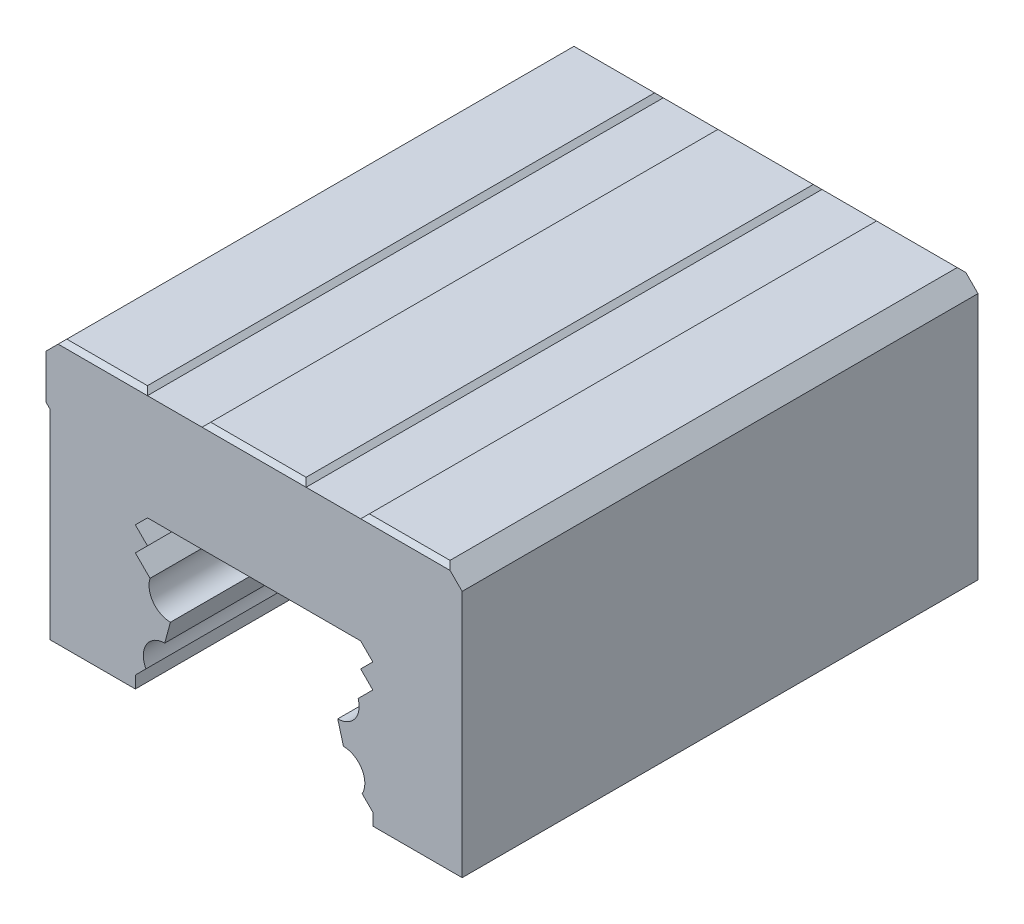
ISO-10303-21;
HEADER;
FILE_DESCRIPTION(('STEP AP214'),'2;1');
FILE_NAME('part.step','',(''),(''),'','','');
FILE_SCHEMA(('AUTOMOTIVE_DESIGN { 1 0 10303 214 1 1 1 1 }'));
ENDSEC;
DATA;
#1=APPLICATION_CONTEXT('core data for automotive mechanical design processes');
#2=APPLICATION_PROTOCOL_DEFINITION('international standard','automotive_design',2000,#1);
#3=PRODUCT_CONTEXT('',#1,'mechanical');
#4=PRODUCT('Part','Part','',(#3));
#5=PRODUCT_RELATED_PRODUCT_CATEGORY('part','',(#4));
#6=PRODUCT_DEFINITION_FORMATION('','',#4);
#7=PRODUCT_DEFINITION_CONTEXT('part definition',#1,'design');
#8=PRODUCT_DEFINITION('design','',#6,#7);
#9=PRODUCT_DEFINITION_SHAPE('','',#8);
#10=(LENGTH_UNIT() NAMED_UNIT(*) SI_UNIT(.MILLI.,.METRE.));
#11=(NAMED_UNIT(*) PLANE_ANGLE_UNIT() SI_UNIT($,.RADIAN.));
#12=(NAMED_UNIT(*) SI_UNIT($,.STERADIAN.) SOLID_ANGLE_UNIT());
#13=UNCERTAINTY_MEASURE_WITH_UNIT(LENGTH_MEASURE(1.E-05),#10,'distance_accuracy_value','');
#14=(GEOMETRIC_REPRESENTATION_CONTEXT(3) GLOBAL_UNCERTAINTY_ASSIGNED_CONTEXT((#13)) GLOBAL_UNIT_ASSIGNED_CONTEXT((#10,
#11,#12)) REPRESENTATION_CONTEXT('',''));
#15=CARTESIAN_POINT('',(0.,0.,0.));
#16=DIRECTION('',(0.,0.,1.));
#17=DIRECTION('',(1.,0.,0.));
#18=AXIS2_PLACEMENT_3D('',#15,#16,#17);
#19=CARTESIAN_POINT('',(9.493,20.8372459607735,29.75));
#20=DIRECTION('',(0.,0.,-1.));
#21=DIRECTION('',(-1.,0.,0.));
#22=AXIS2_PLACEMENT_3D('',#19,#20,#21);
#23=PLANE('',#22);
#24=DIRECTION('',(-0.707106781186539,0.707106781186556,0.));
#25=VECTOR('',#24,1.);
#26=CARTESIAN_POINT('',(-13.6951640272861,19.1012214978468,29.75));
#27=LINE('',#26,#25);
#28=CARTESIAN_POINT('',(-12.0003317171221,17.4063891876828,29.75));
#29=VERTEX_POINT('',#28);
#30=CARTESIAN_POINT('',(-13.6951640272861,19.1012214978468,29.75));
#31=VERTEX_POINT('',#30);
#32=EDGE_CURVE('E312',#29,#31,#27,.T.);
#33=ORIENTED_EDGE('',*,*,#32,.T.);
#34=DIRECTION('',(0.707106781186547,0.707106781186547,0.));
#35=VECTOR('',#34,1.);
#36=CARTESIAN_POINT('',(-12.2955711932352,20.5008143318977,29.75));
#37=LINE('',#36,#35);
#38=CARTESIAN_POINT('',(-12.2955711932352,20.5008143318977,29.75));
#39=VERTEX_POINT('',#38);
#40=EDGE_CURVE('E611',#31,#39,#37,.T.);
#41=ORIENTED_EDGE('',*,*,#40,.T.);
#42=DIRECTION('',(-0.707106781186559,0.707106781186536,0.));
#43=VECTOR('',#42,1.);
#44=CARTESIAN_POINT('',(-13.6951640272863,21.9004071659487,29.75));
#45=LINE('',#44,#43);
#46=CARTESIAN_POINT('',(-13.6951640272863,21.9004071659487,29.75));
#47=VERTEX_POINT('',#46);
#48=EDGE_CURVE('E609',#39,#47,#45,.T.);
#49=ORIENTED_EDGE('',*,*,#48,.T.);
#50=DIRECTION('',(0.707106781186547,0.707106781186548,0.));
#51=VECTOR('',#50,1.);
#52=CARTESIAN_POINT('',(-12.2955711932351,23.3,29.75));
#53=LINE('',#52,#51);
#54=CARTESIAN_POINT('',(-12.2955711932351,23.3,29.75));
#55=VERTEX_POINT('',#54);
#56=EDGE_CURVE('E337',#47,#55,#53,.T.);
#57=ORIENTED_EDGE('',*,*,#56,.T.);
#58=DIRECTION('',(1.,0.,0.));
#59=VECTOR('',#58,1.);
#60=CARTESIAN_POINT('',(-8.15000000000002,23.3,29.75));
#61=LINE('',#60,#59);
#62=CARTESIAN_POINT('',(12.2955711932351,23.3,29.75));
#63=VERTEX_POINT('',#62);
#64=EDGE_CURVE('E315',#55,#63,#61,.T.);
#65=ORIENTED_EDGE('',*,*,#64,.T.);
#66=DIRECTION('',(-0.707106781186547,0.707106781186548,0.));
#67=VECTOR('',#66,1.);
#68=CARTESIAN_POINT('',(12.2955711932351,23.3,29.75));
#69=LINE('',#68,#67);
#70=CARTESIAN_POINT('',(13.6951640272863,21.9004071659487,29.75));
#71=VERTEX_POINT('',#70);
#72=EDGE_CURVE('E345',#71,#63,#69,.T.);
#73=ORIENTED_EDGE('',*,*,#72,.F.);
#74=DIRECTION('',(0.707106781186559,0.707106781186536,0.));
#75=VECTOR('',#74,1.);
#76=CARTESIAN_POINT('',(13.6951640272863,21.9004071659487,29.75));
#77=LINE('',#76,#75);
#78=CARTESIAN_POINT('',(12.2955711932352,20.5008143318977,29.75));
#79=VERTEX_POINT('',#78);
#80=EDGE_CURVE('E359',#79,#71,#77,.T.);
#81=ORIENTED_EDGE('',*,*,#80,.F.);
#82=DIRECTION('',(-0.707106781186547,0.707106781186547,0.));
#83=VECTOR('',#82,1.);
#84=CARTESIAN_POINT('',(12.2955711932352,20.5008143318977,29.75));
#85=LINE('',#84,#83);
#86=CARTESIAN_POINT('',(13.6951640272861,19.1012214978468,29.75));
#87=VERTEX_POINT('',#86);
#88=EDGE_CURVE('E355',#87,#79,#85,.T.);
#89=ORIENTED_EDGE('',*,*,#88,.F.);
#90=DIRECTION('',(0.707106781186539,0.707106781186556,0.));
#91=VECTOR('',#90,1.);
#92=CARTESIAN_POINT('',(13.6951640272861,19.1012214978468,29.75));
#93=LINE('',#92,#91);
#94=CARTESIAN_POINT('',(12.0003317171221,17.4063891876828,29.75));
#95=VERTEX_POINT('',#94);
#96=EDGE_CURVE('E352',#95,#87,#93,.T.);
#97=ORIENTED_EDGE('',*,*,#96,.F.);
#98=CARTESIAN_POINT('',(9.65,16.66,29.75));
#99=DIRECTION('',(0.,0.,-1.));
#100=DIRECTION('',(-1.,0.,0.));
#101=AXIS2_PLACEMENT_3D('',#98,#99,#100);
#102=CIRCLE('',#101,2.466);
#103=CARTESIAN_POINT('',(9.65,14.194,29.75));
#104=VERTEX_POINT('',#103);
#105=EDGE_CURVE('E395',#104,#95,#102,.F.);
#106=ORIENTED_EDGE('',*,*,#105,.F.);
#107=DIRECTION('',(-0.263319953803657,0.964708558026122,0.));
#108=VECTOR('',#107,1.);
#109=CARTESIAN_POINT('',(7.95155010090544,20.4165028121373,29.75));
#110=LINE('',#109,#108);
#111=CARTESIAN_POINT('',(10.31,11.776,29.75));
#112=VERTEX_POINT('',#111);
#113=EDGE_CURVE('E398',#112,#104,#110,.T.);
#114=ORIENTED_EDGE('',*,*,#113,.F.);
#115=CARTESIAN_POINT('',(10.31,9.31,29.75));
#116=DIRECTION('',(0.,0.,-1.));
#117=DIRECTION('',(-1.,0.,0.));
#118=AXIS2_PLACEMENT_3D('',#115,#116,#117);
#119=CIRCLE('',#118,2.466);
#120=CARTESIAN_POINT('',(12.4716066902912,8.12315017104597,29.75));
#121=VERTEX_POINT('',#120);
#122=EDGE_CURVE('E400',#121,#112,#119,.F.);
#123=ORIENTED_EDGE('',*,*,#122,.F.);
#124=DIRECTION('',(-0.707106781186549,0.707106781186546,0.));
#125=VECTOR('',#124,1.);
#126=CARTESIAN_POINT('',(13.6951640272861,6.89959283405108,29.75));
#127=LINE('',#126,#125);
#128=CARTESIAN_POINT('',(13.6951640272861,6.89959283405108,29.75));
#129=VERTEX_POINT('',#128);
#130=EDGE_CURVE('E65',#129,#121,#127,.T.);
#131=ORIENTED_EDGE('',*,*,#130,.F.);
#132=DIRECTION('',(0.,1.,0.));
#133=VECTOR('',#132,1.);
#134=CARTESIAN_POINT('',(13.6951640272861,6.89959283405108,29.75));
#135=LINE('',#134,#133);
#136=CARTESIAN_POINT('',(13.6951640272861,5.5,29.75));
#137=VERTEX_POINT('',#136);
#138=EDGE_CURVE('E356',#137,#129,#135,.T.);
#139=ORIENTED_EDGE('',*,*,#138,.F.);
#140=DIRECTION('',(1.,0.,0.));
#141=VECTOR('',#140,1.);
#142=CARTESIAN_POINT('',(10.3433796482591,5.5,29.75));
#143=LINE('',#142,#141);
#144=CARTESIAN_POINT('',(24.,5.5,29.75));
#145=VERTEX_POINT('',#144);
#146=EDGE_CURVE('E300',#137,#145,#143,.T.);
#147=ORIENTED_EDGE('',*,*,#146,.T.);
#148=DIRECTION('',(0.,1.,0.));
#149=VECTOR('',#148,1.);
#150=CARTESIAN_POINT('',(24.,5.5,29.75));
#151=LINE('',#150,#149);
#152=CARTESIAN_POINT('',(24.,34.1,29.75));
#153=VERTEX_POINT('',#152);
#154=EDGE_CURVE('E417',#145,#153,#151,.T.);
#155=ORIENTED_EDGE('',*,*,#154,.T.);
#156=DIRECTION('',(-0.707106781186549,0.707106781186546,0.));
#157=VECTOR('',#156,1.);
#158=CARTESIAN_POINT('',(24.,34.1,29.75));
#159=LINE('',#158,#157);
#160=CARTESIAN_POINT('',(22.6,35.5,29.75));
#161=VERTEX_POINT('',#160);
#162=EDGE_CURVE('E419',#153,#161,#159,.T.);
#163=ORIENTED_EDGE('',*,*,#162,.T.);
#164=DIRECTION('',(-1.,0.,0.));
#165=VECTOR('',#164,1.);
#166=CARTESIAN_POINT('',(9.49299999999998,35.5,29.75));
#167=LINE('',#166,#165);
#168=CARTESIAN_POINT('',(12.3,35.5,29.75));
#169=VERTEX_POINT('',#168);
#170=EDGE_CURVE('E516',#161,#169,#167,.T.);
#171=ORIENTED_EDGE('',*,*,#170,.T.);
#172=DIRECTION('',(-1.,0.,0.));
#173=VECTOR('',#172,1.);
#174=CARTESIAN_POINT('',(5.99999999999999,35.5,29.75));
#175=LINE('',#174,#173);
#176=CARTESIAN_POINT('',(5.99999999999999,35.5,29.75));
#177=VERTEX_POINT('',#176);
#178=EDGE_CURVE('E422',#169,#177,#175,.T.);
#179=ORIENTED_EDGE('',*,*,#178,.T.);
#180=DIRECTION('',(-1.,0.,0.));
#181=VECTOR('',#180,1.);
#182=CARTESIAN_POINT('',(9.493,35.5,29.75));
#183=LINE('',#182,#181);
#184=CARTESIAN_POINT('',(-6.,35.5,29.75));
#185=VERTEX_POINT('',#184);
#186=EDGE_CURVE('E510',#177,#185,#183,.T.);
#187=ORIENTED_EDGE('',*,*,#186,.T.);
#188=DIRECTION('',(-1.,0.,0.));
#189=VECTOR('',#188,1.);
#190=CARTESIAN_POINT('',(-12.3,35.5,29.75));
#191=LINE('',#190,#189);
#192=CARTESIAN_POINT('',(-12.3,35.5,29.75));
#193=VERTEX_POINT('',#192);
#194=EDGE_CURVE('E425',#185,#193,#191,.T.);
#195=ORIENTED_EDGE('',*,*,#194,.T.);
#196=DIRECTION('',(-1.,0.,0.));
#197=VECTOR('',#196,1.);
#198=CARTESIAN_POINT('',(9.49299999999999,35.5,29.75));
#199=LINE('',#198,#197);
#200=CARTESIAN_POINT('',(-22.6,35.5,29.75));
#201=VERTEX_POINT('',#200);
#202=EDGE_CURVE('E513',#193,#201,#199,.T.);
#203=ORIENTED_EDGE('',*,*,#202,.T.);
#204=DIRECTION('',(-0.707106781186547,-0.707106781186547,0.));
#205=VECTOR('',#204,1.);
#206=CARTESIAN_POINT('',(-24.,34.1,29.75));
#207=LINE('',#206,#205);
#208=CARTESIAN_POINT('',(-24.,34.1,29.75));
#209=VERTEX_POINT('',#208);
#210=EDGE_CURVE('E428',#201,#209,#207,.T.);
#211=ORIENTED_EDGE('',*,*,#210,.T.);
#212=DIRECTION('',(0.,-1.,0.));
#213=VECTOR('',#212,1.);
#214=CARTESIAN_POINT('',(-24.,29.,29.75));
#215=LINE('',#214,#213);
#216=CARTESIAN_POINT('',(-24.,29.,29.75));
#217=VERTEX_POINT('',#216);
#218=EDGE_CURVE('E430',#209,#217,#215,.T.);
#219=ORIENTED_EDGE('',*,*,#218,.T.);
#220=DIRECTION('',(0.707106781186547,-0.707106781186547,0.));
#221=VECTOR('',#220,1.);
#222=CARTESIAN_POINT('',(-23.55,28.55,29.75));
#223=LINE('',#222,#221);
#224=CARTESIAN_POINT('',(-23.55,28.55,29.75));
#225=VERTEX_POINT('',#224);
#226=EDGE_CURVE('E432',#217,#225,#223,.T.);
#227=ORIENTED_EDGE('',*,*,#226,.T.);
#228=DIRECTION('',(0.,-1.,0.));
#229=VECTOR('',#228,1.);
#230=CARTESIAN_POINT('',(-23.55,5.5,29.75));
#231=LINE('',#230,#229);
#232=CARTESIAN_POINT('',(-23.55,5.5,29.75));
#233=VERTEX_POINT('',#232);
#234=EDGE_CURVE('E434',#225,#233,#231,.T.);
#235=ORIENTED_EDGE('',*,*,#234,.T.);
#236=DIRECTION('',(1.,0.,0.));
#237=VECTOR('',#236,1.);
#238=CARTESIAN_POINT('',(-10.3433796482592,5.5,29.75));
#239=LINE('',#238,#237);
#240=CARTESIAN_POINT('',(-13.6951640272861,5.5,29.75));
#241=VERTEX_POINT('',#240);
#242=EDGE_CURVE('E436',#233,#241,#239,.T.);
#243=ORIENTED_EDGE('',*,*,#242,.T.);
#244=DIRECTION('',(0.,1.,0.));
#245=VECTOR('',#244,1.);
#246=CARTESIAN_POINT('',(-13.6951640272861,6.89959283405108,29.75));
#247=LINE('',#246,#245);
#248=CARTESIAN_POINT('',(-13.6951640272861,6.89959283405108,29.75));
#249=VERTEX_POINT('',#248);
#250=EDGE_CURVE('E326',#241,#249,#247,.T.);
#251=ORIENTED_EDGE('',*,*,#250,.T.);
#252=DIRECTION('',(0.707106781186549,0.707106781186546,0.));
#253=VECTOR('',#252,1.);
#254=CARTESIAN_POINT('',(-13.6951640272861,6.89959283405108,29.75));
#255=LINE('',#254,#253);
#256=CARTESIAN_POINT('',(-12.4716066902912,8.12315017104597,29.75));
#257=VERTEX_POINT('',#256);
#258=EDGE_CURVE('E329',#249,#257,#255,.T.);
#259=ORIENTED_EDGE('',*,*,#258,.T.);
#260=CARTESIAN_POINT('',(-10.31,9.31,29.75));
#261=DIRECTION('',(0.,0.,-1.));
#262=DIRECTION('',(-1.,0.,0.));
#263=AXIS2_PLACEMENT_3D('',#260,#261,#262);
#264=CIRCLE('',#263,2.466);
#265=CARTESIAN_POINT('',(-10.31,11.776,29.75));
#266=VERTEX_POINT('',#265);
#267=EDGE_CURVE('E413',#257,#266,#264,.T.);
#268=ORIENTED_EDGE('',*,*,#267,.T.);
#269=DIRECTION('',(0.263319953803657,0.964708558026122,0.));
#270=VECTOR('',#269,1.);
#271=CARTESIAN_POINT('',(-6.6351102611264,25.2394596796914,29.75));
#272=LINE('',#271,#270);
#273=CARTESIAN_POINT('',(-9.65,14.194,29.75));
#274=VERTEX_POINT('',#273);
#275=EDGE_CURVE('E411',#266,#274,#272,.T.);
#276=ORIENTED_EDGE('',*,*,#275,.T.);
#277=CARTESIAN_POINT('',(-9.65,16.66,29.75));
#278=DIRECTION('',(0.,0.,-1.));
#279=DIRECTION('',(-1.,0.,0.));
#280=AXIS2_PLACEMENT_3D('',#277,#278,#279);
#281=CIRCLE('',#280,2.466);
#282=EDGE_CURVE('E408',#274,#29,#281,.T.);
#283=ORIENTED_EDGE('',*,*,#282,.T.);
#284=EDGE_LOOP('',(#33,#41,#49,#57,#65,#73,#81,#89,#97,#106,#114,#123,#131,#139,#147,#155,#163,
#171,#179,#187,#195,#203,#211,#219,#227,#235,#243,#251,#259,#268,#276,#283));
#285=FACE_BOUND('',#284,.T.);
#286=ADVANCED_FACE('F42',(#285),#23,.F.);
#287=CARTESIAN_POINT('',(9.493,20.8372459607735,-29.75));
#288=DIRECTION('',(0.,0.,-1.));
#289=DIRECTION('',(-1.,0.,0.));
#290=AXIS2_PLACEMENT_3D('',#287,#288,#289);
#291=PLANE('',#290);
#292=DIRECTION('',(0.707106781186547,0.707106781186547,0.));
#293=VECTOR('',#292,1.);
#294=CARTESIAN_POINT('',(-12.2955711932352,20.5008143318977,-29.75));
#295=LINE('',#294,#293);
#296=CARTESIAN_POINT('',(-13.6951640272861,19.1012214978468,-29.75));
#297=VERTEX_POINT('',#296);
#298=CARTESIAN_POINT('',(-12.2955711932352,20.5008143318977,-29.75));
#299=VERTEX_POINT('',#298);
#300=EDGE_CURVE('E320',#297,#299,#295,.T.);
#301=ORIENTED_EDGE('',*,*,#300,.F.);
#302=DIRECTION('',(-0.707106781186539,0.707106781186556,0.));
#303=VECTOR('',#302,1.);
#304=CARTESIAN_POINT('',(-13.6951640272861,19.1012214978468,-29.75));
#305=LINE('',#304,#303);
#306=CARTESIAN_POINT('',(-12.0003317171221,17.4063891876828,-29.75));
#307=VERTEX_POINT('',#306);
#308=EDGE_CURVE('E316',#307,#297,#305,.T.);
#309=ORIENTED_EDGE('',*,*,#308,.F.);
#310=CARTESIAN_POINT('',(-9.65,16.66,-29.75));
#311=DIRECTION('',(0.,0.,-1.));
#312=DIRECTION('',(-1.,0.,0.));
#313=AXIS2_PLACEMENT_3D('',#310,#311,#312);
#314=CIRCLE('',#313,2.466);
#315=CARTESIAN_POINT('',(-9.65,14.194,-29.75));
#316=VERTEX_POINT('',#315);
#317=EDGE_CURVE('E564',#316,#307,#314,.T.);
#318=ORIENTED_EDGE('',*,*,#317,.F.);
#319=DIRECTION('',(0.263319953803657,0.964708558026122,0.));
#320=VECTOR('',#319,1.);
#321=CARTESIAN_POINT('',(-6.6351102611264,25.2394596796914,-29.75));
#322=LINE('',#321,#320);
#323=CARTESIAN_POINT('',(-10.31,11.776,-29.75));
#324=VERTEX_POINT('',#323);
#325=EDGE_CURVE('E567',#324,#316,#322,.T.);
#326=ORIENTED_EDGE('',*,*,#325,.F.);
#327=CARTESIAN_POINT('',(-10.31,9.31,-29.75));
#328=DIRECTION('',(0.,0.,-1.));
#329=DIRECTION('',(-1.,0.,0.));
#330=AXIS2_PLACEMENT_3D('',#327,#328,#329);
#331=CIRCLE('',#330,2.466);
#332=CARTESIAN_POINT('',(-12.4716066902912,8.12315017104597,-29.75));
#333=VERTEX_POINT('',#332);
#334=EDGE_CURVE('E570',#333,#324,#331,.T.);
#335=ORIENTED_EDGE('',*,*,#334,.F.);
#336=DIRECTION('',(0.707106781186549,0.707106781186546,0.));
#337=VECTOR('',#336,1.);
#338=CARTESIAN_POINT('',(-13.6951640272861,6.89959283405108,-29.75));
#339=LINE('',#338,#337);
#340=CARTESIAN_POINT('',(-13.6951640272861,6.89959283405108,-29.75));
#341=VERTEX_POINT('',#340);
#342=EDGE_CURVE('E57',#341,#333,#339,.T.);
#343=ORIENTED_EDGE('',*,*,#342,.F.);
#344=DIRECTION('',(0.,1.,0.));
#345=VECTOR('',#344,1.);
#346=CARTESIAN_POINT('',(-13.6951640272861,6.89959283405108,-29.75));
#347=LINE('',#346,#345);
#348=CARTESIAN_POINT('',(-13.6951640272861,5.5,-29.75));
#349=VERTEX_POINT('',#348);
#350=EDGE_CURVE('E325',#349,#341,#347,.T.);
#351=ORIENTED_EDGE('',*,*,#350,.F.);
#352=DIRECTION('',(1.,0.,0.));
#353=VECTOR('',#352,1.);
#354=CARTESIAN_POINT('',(-10.3433796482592,5.5,-29.75));
#355=LINE('',#354,#353);
#356=CARTESIAN_POINT('',(-23.55,5.5,-29.75));
#357=VERTEX_POINT('',#356);
#358=EDGE_CURVE('E301',#357,#349,#355,.T.);
#359=ORIENTED_EDGE('',*,*,#358,.F.);
#360=DIRECTION('',(0.,-1.,0.));
#361=VECTOR('',#360,1.);
#362=CARTESIAN_POINT('',(-23.55,5.5,-29.75));
#363=LINE('',#362,#361);
#364=CARTESIAN_POINT('',(-23.55,28.55,-29.75));
#365=VERTEX_POINT('',#364);
#366=EDGE_CURVE('E459',#365,#357,#363,.T.);
#367=ORIENTED_EDGE('',*,*,#366,.F.);
#368=DIRECTION('',(0.707106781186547,-0.707106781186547,0.));
#369=VECTOR('',#368,1.);
#370=CARTESIAN_POINT('',(-23.55,28.55,-29.75));
#371=LINE('',#370,#369);
#372=CARTESIAN_POINT('',(-24.,29.,-29.75));
#373=VERTEX_POINT('',#372);
#374=EDGE_CURVE('E457',#373,#365,#371,.T.);
#375=ORIENTED_EDGE('',*,*,#374,.F.);
#376=DIRECTION('',(0.,-1.,0.));
#377=VECTOR('',#376,1.);
#378=CARTESIAN_POINT('',(-24.,29.,-29.75));
#379=LINE('',#378,#377);
#380=CARTESIAN_POINT('',(-24.,34.1,-29.75));
#381=VERTEX_POINT('',#380);
#382=EDGE_CURVE('E455',#381,#373,#379,.T.);
#383=ORIENTED_EDGE('',*,*,#382,.F.);
#384=DIRECTION('',(-0.707106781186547,-0.707106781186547,0.));
#385=VECTOR('',#384,1.);
#386=CARTESIAN_POINT('',(-24.,34.1,-29.75));
#387=LINE('',#386,#385);
#388=CARTESIAN_POINT('',(-22.6,35.5,-29.75));
#389=VERTEX_POINT('',#388);
#390=EDGE_CURVE('E453',#389,#381,#387,.T.);
#391=ORIENTED_EDGE('',*,*,#390,.F.);
#392=DIRECTION('',(1.,0.,0.));
#393=VECTOR('',#392,1.);
#394=CARTESIAN_POINT('',(-12.8,35.5,-29.75));
#395=LINE('',#394,#393);
#396=CARTESIAN_POINT('',(-12.3,35.5,-29.75));
#397=VERTEX_POINT('',#396);
#398=EDGE_CURVE('E562',#389,#397,#395,.T.);
#399=ORIENTED_EDGE('',*,*,#398,.T.);
#400=DIRECTION('',(-1.,0.,0.));
#401=VECTOR('',#400,1.);
#402=CARTESIAN_POINT('',(-12.3,35.5,-29.75));
#403=LINE('',#402,#401);
#404=CARTESIAN_POINT('',(-6.,35.5,-29.75));
#405=VERTEX_POINT('',#404);
#406=EDGE_CURVE('E450',#405,#397,#403,.T.);
#407=ORIENTED_EDGE('',*,*,#406,.F.);
#408=DIRECTION('',(1.,0.,0.));
#409=VECTOR('',#408,1.);
#410=CARTESIAN_POINT('',(5.5,35.5,-29.75));
#411=LINE('',#410,#409);
#412=CARTESIAN_POINT('',(5.99999999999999,35.5,-29.75));
#413=VERTEX_POINT('',#412);
#414=EDGE_CURVE('E558',#405,#413,#411,.T.);
#415=ORIENTED_EDGE('',*,*,#414,.T.);
#416=DIRECTION('',(-1.,0.,0.));
#417=VECTOR('',#416,1.);
#418=CARTESIAN_POINT('',(5.99999999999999,35.5,-29.75));
#419=LINE('',#418,#417);
#420=CARTESIAN_POINT('',(12.3,35.5,-29.75));
#421=VERTEX_POINT('',#420);
#422=EDGE_CURVE('E447',#421,#413,#419,.T.);
#423=ORIENTED_EDGE('',*,*,#422,.F.);
#424=DIRECTION('',(1.,0.,0.));
#425=VECTOR('',#424,1.);
#426=CARTESIAN_POINT('',(22.1,35.5,-29.75));
#427=LINE('',#426,#425);
#428=CARTESIAN_POINT('',(22.6,35.5,-29.75));
#429=VERTEX_POINT('',#428);
#430=EDGE_CURVE('E560',#421,#429,#427,.T.);
#431=ORIENTED_EDGE('',*,*,#430,.T.);
#432=DIRECTION('',(-0.707106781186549,0.707106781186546,0.));
#433=VECTOR('',#432,1.);
#434=CARTESIAN_POINT('',(24.,34.1,-29.75));
#435=LINE('',#434,#433);
#436=CARTESIAN_POINT('',(24.,34.1,-29.75));
#437=VERTEX_POINT('',#436);
#438=EDGE_CURVE('E444',#437,#429,#435,.T.);
#439=ORIENTED_EDGE('',*,*,#438,.F.);
#440=DIRECTION('',(0.,1.,0.));
#441=VECTOR('',#440,1.);
#442=CARTESIAN_POINT('',(24.,5.5,-29.75));
#443=LINE('',#442,#441);
#444=CARTESIAN_POINT('',(24.,5.5,-29.75));
#445=VERTEX_POINT('',#444);
#446=EDGE_CURVE('E442',#445,#437,#443,.T.);
#447=ORIENTED_EDGE('',*,*,#446,.F.);
#448=DIRECTION('',(1.,0.,0.));
#449=VECTOR('',#448,1.);
#450=CARTESIAN_POINT('',(10.3433796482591,5.5,-29.75));
#451=LINE('',#450,#449);
#452=CARTESIAN_POINT('',(13.6951640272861,5.5,-29.75));
#453=VERTEX_POINT('',#452);
#454=EDGE_CURVE('E415',#453,#445,#451,.T.);
#455=ORIENTED_EDGE('',*,*,#454,.F.);
#456=DIRECTION('',(0.,1.,0.));
#457=VECTOR('',#456,1.);
#458=CARTESIAN_POINT('',(13.6951640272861,6.89959283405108,-29.75));
#459=LINE('',#458,#457);
#460=CARTESIAN_POINT('',(13.6951640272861,6.89959283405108,-29.75));
#461=VERTEX_POINT('',#460);
#462=EDGE_CURVE('E383',#453,#461,#459,.T.);
#463=ORIENTED_EDGE('',*,*,#462,.T.);
#464=DIRECTION('',(-0.707106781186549,0.707106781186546,0.));
#465=VECTOR('',#464,1.);
#466=CARTESIAN_POINT('',(13.6951640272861,6.89959283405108,-29.75));
#467=LINE('',#466,#465);
#468=CARTESIAN_POINT('',(12.4716066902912,8.12315017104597,-29.75));
#469=VERTEX_POINT('',#468);
#470=EDGE_CURVE('E376',#461,#469,#467,.T.);
#471=ORIENTED_EDGE('',*,*,#470,.T.);
#472=CARTESIAN_POINT('',(10.31,9.31,-29.75));
#473=DIRECTION('',(0.,0.,-1.));
#474=DIRECTION('',(-1.,0.,0.));
#475=AXIS2_PLACEMENT_3D('',#472,#473,#474);
#476=CIRCLE('',#475,2.466);
#477=CARTESIAN_POINT('',(10.31,11.776,-29.75));
#478=VERTEX_POINT('',#477);
#479=EDGE_CURVE('E11',#469,#478,#476,.F.);
#480=ORIENTED_EDGE('',*,*,#479,.T.);
#481=DIRECTION('',(-0.263319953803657,0.964708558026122,0.));
#482=VECTOR('',#481,1.);
#483=CARTESIAN_POINT('',(7.95155010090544,20.4165028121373,-29.75));
#484=LINE('',#483,#482);
#485=CARTESIAN_POINT('',(9.65,14.194,-29.75));
#486=VERTEX_POINT('',#485);
#487=EDGE_CURVE('E50',#478,#486,#484,.T.);
#488=ORIENTED_EDGE('',*,*,#487,.T.);
#489=CARTESIAN_POINT('',(9.65,16.66,-29.75));
#490=DIRECTION('',(0.,0.,-1.));
#491=DIRECTION('',(-1.,0.,0.));
#492=AXIS2_PLACEMENT_3D('',#489,#490,#491);
#493=CIRCLE('',#492,2.466);
#494=CARTESIAN_POINT('',(12.0003317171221,17.4063891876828,-29.75));
#495=VERTEX_POINT('',#494);
#496=EDGE_CURVE('E572',#486,#495,#493,.F.);
#497=ORIENTED_EDGE('',*,*,#496,.T.);
#498=DIRECTION('',(0.707106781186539,0.707106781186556,0.));
#499=VECTOR('',#498,1.);
#500=CARTESIAN_POINT('',(13.6951640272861,19.1012214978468,-29.75));
#501=LINE('',#500,#499);
#502=CARTESIAN_POINT('',(13.6951640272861,19.1012214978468,-29.75));
#503=VERTEX_POINT('',#502);
#504=EDGE_CURVE('E341',#495,#503,#501,.T.);
#505=ORIENTED_EDGE('',*,*,#504,.T.);
#506=DIRECTION('',(-0.707106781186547,0.707106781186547,0.));
#507=VECTOR('',#506,1.);
#508=CARTESIAN_POINT('',(12.2955711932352,20.5008143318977,-29.75));
#509=LINE('',#508,#507);
#510=CARTESIAN_POINT('',(12.2955711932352,20.5008143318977,-29.75));
#511=VERTEX_POINT('',#510);
#512=EDGE_CURVE('E344',#503,#511,#509,.T.);
#513=ORIENTED_EDGE('',*,*,#512,.T.);
#514=DIRECTION('',(0.707106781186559,0.707106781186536,0.));
#515=VECTOR('',#514,1.);
#516=CARTESIAN_POINT('',(13.6951640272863,21.9004071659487,-29.75));
#517=LINE('',#516,#515);
#518=CARTESIAN_POINT('',(13.6951640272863,21.9004071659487,-29.75));
#519=VERTEX_POINT('',#518);
#520=EDGE_CURVE('E348',#511,#519,#517,.T.);
#521=ORIENTED_EDGE('',*,*,#520,.T.);
#522=DIRECTION('',(-0.707106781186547,0.707106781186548,0.));
#523=VECTOR('',#522,1.);
#524=CARTESIAN_POINT('',(12.2955711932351,23.3,-29.75));
#525=LINE('',#524,#523);
#526=CARTESIAN_POINT('',(12.2955711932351,23.3,-29.75));
#527=VERTEX_POINT('',#526);
#528=EDGE_CURVE('E295',#519,#527,#525,.T.);
#529=ORIENTED_EDGE('',*,*,#528,.T.);
#530=DIRECTION('',(1.,0.,0.));
#531=VECTOR('',#530,1.);
#532=CARTESIAN_POINT('',(-8.15000000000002,23.3,-29.75));
#533=LINE('',#532,#531);
#534=CARTESIAN_POINT('',(-12.2955711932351,23.3,-29.75));
#535=VERTEX_POINT('',#534);
#536=EDGE_CURVE('E287',#535,#527,#533,.T.);
#537=ORIENTED_EDGE('',*,*,#536,.F.);
#538=DIRECTION('',(0.707106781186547,0.707106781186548,0.));
#539=VECTOR('',#538,1.);
#540=CARTESIAN_POINT('',(-12.2955711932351,23.3,-29.75));
#541=LINE('',#540,#539);
#542=CARTESIAN_POINT('',(-13.6951640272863,21.9004071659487,-29.75));
#543=VERTEX_POINT('',#542);
#544=EDGE_CURVE('E292',#543,#535,#541,.T.);
#545=ORIENTED_EDGE('',*,*,#544,.F.);
#546=DIRECTION('',(-0.707106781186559,0.707106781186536,0.));
#547=VECTOR('',#546,1.);
#548=CARTESIAN_POINT('',(-13.6951640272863,21.9004071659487,-29.75));
#549=LINE('',#548,#547);
#550=EDGE_CURVE('E311',#299,#543,#549,.T.);
#551=ORIENTED_EDGE('',*,*,#550,.F.);
#552=EDGE_LOOP('',(#301,#309,#318,#326,#335,#343,#351,#359,#367,#375,#383,#391,#399,#407,#415,
#423,#431,#439,#447,#455,#463,#471,#480,#488,#497,#505,#513,#521,#529,#537,#545,#551));
#553=FACE_BOUND('',#552,.T.);
#554=ADVANCED_FACE('F290',(#553),#291,.T.);
#555=CARTESIAN_POINT('',(-10.3433796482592,5.5,29.75));
#556=DIRECTION('',(0.,1.,0.));
#557=DIRECTION('',(-1.,0.,0.));
#558=AXIS2_PLACEMENT_3D('',#555,#556,#557);
#559=PLANE('',#558);
#560=DIRECTION('',(0.,0.,1.));
#561=VECTOR('',#560,1.);
#562=CARTESIAN_POINT('',(-13.6951640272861,5.5,-29.75));
#563=LINE('',#562,#561);
#564=EDGE_CURVE('E334',#349,#241,#563,.T.);
#565=ORIENTED_EDGE('',*,*,#564,.T.);
#566=ORIENTED_EDGE('',*,*,#242,.F.);
#567=DIRECTION('',(0.,0.,-1.));
#568=VECTOR('',#567,1.);
#569=CARTESIAN_POINT('',(-23.55,5.5,29.75));
#570=LINE('',#569,#568);
#571=EDGE_CURVE('E440',#233,#357,#570,.T.);
#572=ORIENTED_EDGE('',*,*,#571,.T.);
#573=ORIENTED_EDGE('',*,*,#358,.T.);
#574=EDGE_LOOP('',(#565,#566,#572,#573));
#575=FACE_BOUND('',#574,.T.);
#576=ADVANCED_FACE('F648',(#575),#559,.F.);
#577=CARTESIAN_POINT('',(-10.31,9.31,207.009188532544));
#578=DIRECTION('',(0.,0.,-1.));
#579=DIRECTION('',(-1.,0.,0.));
#580=AXIS2_PLACEMENT_3D('',#577,#578,#579);
#581=CYLINDRICAL_SURFACE('',#580,2.466);
#582=DIRECTION('',(0.,0.,1.));
#583=VECTOR('',#582,1.);
#584=CARTESIAN_POINT('',(-12.4716066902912,8.12315017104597,-29.75));
#585=LINE('',#584,#583);
#586=EDGE_CURVE('E328',#333,#257,#585,.T.);
#587=ORIENTED_EDGE('',*,*,#586,.F.);
#588=ORIENTED_EDGE('',*,*,#334,.T.);
#589=DIRECTION('',(0.,0.,-1.));
#590=VECTOR('',#589,1.);
#591=CARTESIAN_POINT('',(-10.31,11.776,207.009188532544));
#592=LINE('',#591,#590);
#593=EDGE_CURVE('E405',#266,#324,#592,.T.);
#594=ORIENTED_EDGE('',*,*,#593,.F.);
#595=ORIENTED_EDGE('',*,*,#267,.F.);
#596=EDGE_LOOP('',(#587,#588,#594,#595));
#597=FACE_BOUND('',#596,.T.);
#598=ADVANCED_FACE('F642',(#597),#581,.F.);
#599=CARTESIAN_POINT('',(-9.65,16.66,207.009188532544));
#600=DIRECTION('',(0.,0.,-1.));
#601=DIRECTION('',(-1.,0.,0.));
#602=AXIS2_PLACEMENT_3D('',#599,#600,#601);
#603=CYLINDRICAL_SURFACE('',#602,2.466);
#604=DIRECTION('',(0.,0.,1.));
#605=VECTOR('',#604,1.);
#606=CARTESIAN_POINT('',(-12.0003317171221,17.4063891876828,-29.75));
#607=LINE('',#606,#605);
#608=EDGE_CURVE('E381',#307,#29,#607,.T.);
#609=ORIENTED_EDGE('',*,*,#608,.T.);
#610=ORIENTED_EDGE('',*,*,#282,.F.);
#611=DIRECTION('',(0.,0.,-1.));
#612=VECTOR('',#611,1.);
#613=CARTESIAN_POINT('',(-9.65,14.194,207.009188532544));
#614=LINE('',#613,#612);
#615=EDGE_CURVE('E402',#274,#316,#614,.T.);
#616=ORIENTED_EDGE('',*,*,#615,.T.);
#617=ORIENTED_EDGE('',*,*,#317,.T.);
#618=EDGE_LOOP('',(#609,#610,#616,#617));
#619=FACE_BOUND('',#618,.T.);
#620=ADVANCED_FACE('F632',(#619),#603,.F.);
#621=CARTESIAN_POINT('',(10.3433796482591,5.5,29.75));
#622=DIRECTION('',(0.,1.,0.));
#623=DIRECTION('',(-1.,0.,0.));
#624=AXIS2_PLACEMENT_3D('',#621,#622,#623);
#625=PLANE('',#624);
#626=ORIENTED_EDGE('',*,*,#146,.F.);
#627=DIRECTION('',(0.,0.,1.));
#628=VECTOR('',#627,1.);
#629=CARTESIAN_POINT('',(13.6951640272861,5.5,-29.75));
#630=LINE('',#629,#628);
#631=EDGE_CURVE('E374',#453,#137,#630,.T.);
#632=ORIENTED_EDGE('',*,*,#631,.F.);
#633=ORIENTED_EDGE('',*,*,#454,.T.);
#634=DIRECTION('',(0.,0.,-1.));
#635=VECTOR('',#634,1.);
#636=CARTESIAN_POINT('',(24.,5.5,29.75));
#637=LINE('',#636,#635);
#638=EDGE_CURVE('E507',#145,#445,#637,.T.);
#639=ORIENTED_EDGE('',*,*,#638,.F.);
#640=EDGE_LOOP('',(#626,#632,#633,#639));
#641=FACE_BOUND('',#640,.T.);
#642=ADVANCED_FACE('F740',(#641),#625,.F.);
#643=CARTESIAN_POINT('',(10.31,9.31,207.009188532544));
#644=DIRECTION('',(0.,0.,-1.));
#645=DIRECTION('',(-1.,0.,0.));
#646=AXIS2_PLACEMENT_3D('',#643,#644,#645);
#647=CYLINDRICAL_SURFACE('',#646,2.466);
#648=DIRECTION('',(0.,0.,1.));
#649=VECTOR('',#648,1.);
#650=CARTESIAN_POINT('',(12.4716066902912,8.12315017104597,-29.75));
#651=LINE('',#650,#649);
#652=EDGE_CURVE('E379',#469,#121,#651,.T.);
#653=ORIENTED_EDGE('',*,*,#652,.T.);
#654=ORIENTED_EDGE('',*,*,#122,.T.);
#655=DIRECTION('',(0.,0.,-1.));
#656=VECTOR('',#655,1.);
#657=CARTESIAN_POINT('',(10.31,11.776,207.009188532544));
#658=LINE('',#657,#656);
#659=EDGE_CURVE('E392',#112,#478,#658,.T.);
#660=ORIENTED_EDGE('',*,*,#659,.T.);
#661=ORIENTED_EDGE('',*,*,#479,.F.);
#662=EDGE_LOOP('',(#653,#654,#660,#661));
#663=FACE_BOUND('',#662,.T.);
#664=ADVANCED_FACE('F583',(#663),#647,.F.);
#665=CARTESIAN_POINT('',(9.65,16.66,207.009188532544));
#666=DIRECTION('',(0.,0.,-1.));
#667=DIRECTION('',(-1.,0.,0.));
#668=AXIS2_PLACEMENT_3D('',#665,#666,#667);
#669=CYLINDRICAL_SURFACE('',#668,2.466);
#670=DIRECTION('',(0.,0.,1.));
#671=VECTOR('',#670,1.);
#672=CARTESIAN_POINT('',(12.0003317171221,17.4063891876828,-29.75));
#673=LINE('',#672,#671);
#674=EDGE_CURVE('E351',#495,#95,#673,.T.);
#675=ORIENTED_EDGE('',*,*,#674,.F.);
#676=ORIENTED_EDGE('',*,*,#496,.F.);
#677=DIRECTION('',(0.,0.,-1.));
#678=VECTOR('',#677,1.);
#679=CARTESIAN_POINT('',(9.65,14.194,207.009188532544));
#680=LINE('',#679,#678);
#681=EDGE_CURVE('E366',#104,#486,#680,.T.);
#682=ORIENTED_EDGE('',*,*,#681,.F.);
#683=ORIENTED_EDGE('',*,*,#105,.T.);
#684=EDGE_LOOP('',(#675,#676,#682,#683));
#685=FACE_BOUND('',#684,.T.);
#686=ADVANCED_FACE('F592',(#685),#669,.F.);
#687=CARTESIAN_POINT('',(24.,5.5,29.75));
#688=DIRECTION('',(-1.,0.,0.));
#689=DIRECTION('',(0.,-1.,0.));
#690=AXIS2_PLACEMENT_3D('',#687,#688,#689);
#691=PLANE('',#690);
#692=ORIENTED_EDGE('',*,*,#446,.T.);
#693=DIRECTION('',(0.,0.,-1.));
#694=VECTOR('',#693,1.);
#695=CARTESIAN_POINT('',(24.,34.1,29.75));
#696=LINE('',#695,#694);
#697=EDGE_CURVE('E504',#153,#437,#696,.T.);
#698=ORIENTED_EDGE('',*,*,#697,.F.);
#699=ORIENTED_EDGE('',*,*,#154,.F.);
#700=ORIENTED_EDGE('',*,*,#638,.T.);
#701=EDGE_LOOP('',(#692,#698,#699,#700));
#702=FACE_BOUND('',#701,.T.);
#703=ADVANCED_FACE('F735',(#702),#691,.F.);
#704=CARTESIAN_POINT('',(24.,34.1,29.75));
#705=DIRECTION('',(-0.707106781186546,-0.707106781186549,0.));
#706=DIRECTION('',(0.707106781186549,-0.707106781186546,0.));
#707=AXIS2_PLACEMENT_3D('',#704,#705,#706);
#708=PLANE('',#707);
#709=DIRECTION('',(0.,0.,-1.));
#710=VECTOR('',#709,1.);
#711=CARTESIAN_POINT('',(22.1,36.,29.75));
#712=LINE('',#711,#710);
#713=CARTESIAN_POINT('',(22.1,36.,29.25));
#714=VERTEX_POINT('',#713);
#715=CARTESIAN_POINT('',(22.1,36.,-29.25));
#716=VERTEX_POINT('',#715);
#717=EDGE_CURVE('E501',#714,#716,#712,.T.);
#718=ORIENTED_EDGE('',*,*,#717,.F.);
#719=DIRECTION('',(-0.57735026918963,0.577350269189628,-0.577350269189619));
#720=VECTOR('',#719,1.);
#721=CARTESIAN_POINT('',(18.2309999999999,39.8690000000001,25.381));
#722=LINE('',#721,#720);
#723=EDGE_CURVE('E530',#714,#161,#722,.F.);
#724=ORIENTED_EDGE('',*,*,#723,.T.);
#725=ORIENTED_EDGE('',*,*,#162,.F.);
#726=ORIENTED_EDGE('',*,*,#697,.T.);
#727=ORIENTED_EDGE('',*,*,#438,.T.);
#728=DIRECTION('',(-0.57735026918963,0.577350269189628,0.577350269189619));
#729=VECTOR('',#728,1.);
#730=CARTESIAN_POINT('',(22.1,36.,-29.25));
#731=LINE('',#730,#729);
#732=EDGE_CURVE('E528',#429,#716,#731,.T.);
#733=ORIENTED_EDGE('',*,*,#732,.T.);
#734=EDGE_LOOP('',(#718,#724,#725,#726,#727,#733));
#735=FACE_BOUND('',#734,.T.);
#736=ADVANCED_FACE('F721',(#735),#708,.F.);
#737=CARTESIAN_POINT('',(22.1,36.,29.75));
#738=DIRECTION('',(0.,-1.,0.));
#739=DIRECTION('',(1.,0.,0.));
#740=AXIS2_PLACEMENT_3D('',#737,#738,#739);
#741=PLANE('',#740);
#742=DIRECTION('',(0.,0.,-1.));
#743=VECTOR('',#742,1.);
#744=CARTESIAN_POINT('',(12.8,36.,29.75));
#745=LINE('',#744,#743);
#746=CARTESIAN_POINT('',(12.8,36.,29.25));
#747=VERTEX_POINT('',#746);
#748=CARTESIAN_POINT('',(12.8,36.,-29.25));
#749=VERTEX_POINT('',#748);
#750=EDGE_CURVE('E498',#747,#749,#745,.T.);
#751=ORIENTED_EDGE('',*,*,#750,.F.);
#752=DIRECTION('',(1.,0.,0.));
#753=VECTOR('',#752,1.);
#754=CARTESIAN_POINT('',(22.1,36.,29.25));
#755=LINE('',#754,#753);
#756=EDGE_CURVE('E526',#747,#714,#755,.T.);
#757=ORIENTED_EDGE('',*,*,#756,.T.);
#758=ORIENTED_EDGE('',*,*,#717,.T.);
#759=DIRECTION('',(-1.,0.,0.));
#760=VECTOR('',#759,1.);
#761=CARTESIAN_POINT('',(12.8,36.,-29.25));
#762=LINE('',#761,#760);
#763=EDGE_CURVE('E523',#716,#749,#762,.T.);
#764=ORIENTED_EDGE('',*,*,#763,.T.);
#765=EDGE_LOOP('',(#751,#757,#758,#764));
#766=FACE_BOUND('',#765,.T.);
#767=ADVANCED_FACE('F725',(#766),#741,.F.);
#768=CARTESIAN_POINT('',(12.3,35.5,29.75));
#769=DIRECTION('',(0.707106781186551,-0.707106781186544,0.));
#770=DIRECTION('',(0.707106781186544,0.707106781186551,0.));
#771=AXIS2_PLACEMENT_3D('',#768,#769,#770);
#772=PLANE('',#771);
#773=DIRECTION('',(0.,0.,-1.));
#774=VECTOR('',#773,1.);
#775=CARTESIAN_POINT('',(12.3,35.5,29.75));
#776=LINE('',#775,#774);
#777=EDGE_CURVE('E495',#169,#421,#776,.T.);
#778=ORIENTED_EDGE('',*,*,#777,.F.);
#779=DIRECTION('',(-0.577350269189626,-0.577350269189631,0.57735026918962));
#780=VECTOR('',#779,1.);
#781=CARTESIAN_POINT('',(11.3643333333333,34.5643333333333,30.6856666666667));
#782=LINE('',#781,#780);
#783=EDGE_CURVE('E521',#169,#747,#782,.F.);
#784=ORIENTED_EDGE('',*,*,#783,.T.);
#785=ORIENTED_EDGE('',*,*,#750,.T.);
#786=DIRECTION('',(-0.577350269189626,-0.577350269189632,-0.57735026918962));
#787=VECTOR('',#786,1.);
#788=CARTESIAN_POINT('',(15.9,39.1,-26.15));
#789=LINE('',#788,#787);
#790=EDGE_CURVE('E519',#749,#421,#789,.T.);
#791=ORIENTED_EDGE('',*,*,#790,.T.);
#792=EDGE_LOOP('',(#778,#784,#785,#791));
#793=FACE_BOUND('',#792,.T.);
#794=ADVANCED_FACE('F791',(#793),#772,.F.);
#795=CARTESIAN_POINT('',(5.99999999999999,35.5,29.75));
#796=DIRECTION('',(0.,-1.,0.));
#797=DIRECTION('',(0.,0.,-1.));
#798=AXIS2_PLACEMENT_3D('',#795,#796,#797);
#799=PLANE('',#798);
#800=ORIENTED_EDGE('',*,*,#422,.T.);
#801=DIRECTION('',(0.,0.,-1.));
#802=VECTOR('',#801,1.);
#803=CARTESIAN_POINT('',(5.99999999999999,35.5,29.75));
#804=LINE('',#803,#802);
#805=EDGE_CURVE('E492',#177,#413,#804,.T.);
#806=ORIENTED_EDGE('',*,*,#805,.F.);
#807=ORIENTED_EDGE('',*,*,#178,.F.);
#808=ORIENTED_EDGE('',*,*,#777,.T.);
#809=EDGE_LOOP('',(#800,#806,#807,#808));
#810=FACE_BOUND('',#809,.T.);
#811=ADVANCED_FACE('F712',(#810),#799,.F.);
#812=CARTESIAN_POINT('',(5.5,36.,29.75));
#813=DIRECTION('',(-0.707106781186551,-0.707106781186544,0.));
#814=DIRECTION('',(0.707106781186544,-0.707106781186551,0.));
#815=AXIS2_PLACEMENT_3D('',#812,#813,#814);
#816=PLANE('',#815);
#817=DIRECTION('',(0.,0.,-1.));
#818=VECTOR('',#817,1.);
#819=CARTESIAN_POINT('',(5.5,36.,29.75));
#820=LINE('',#819,#818);
#821=CARTESIAN_POINT('',(5.5,36.,29.25));
#822=VERTEX_POINT('',#821);
#823=CARTESIAN_POINT('',(5.5,36.,-29.25));
#824=VERTEX_POINT('',#823);
#825=EDGE_CURVE('E489',#822,#824,#820,.T.);
#826=ORIENTED_EDGE('',*,*,#825,.F.);
#827=DIRECTION('',(-0.577350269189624,0.577350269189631,-0.577350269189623));
#828=VECTOR('',#827,1.);
#829=CARTESIAN_POINT('',(7.16433333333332,34.3356666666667,30.9143333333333));
#830=LINE('',#829,#828);
#831=EDGE_CURVE('E556',#822,#177,#830,.F.);
#832=ORIENTED_EDGE('',*,*,#831,.T.);
#833=ORIENTED_EDGE('',*,*,#805,.T.);
#834=DIRECTION('',(-0.577350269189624,0.57735026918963,0.577350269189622));
#835=VECTOR('',#834,1.);
#836=CARTESIAN_POINT('',(1.83333333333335,39.6666666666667,-25.5833333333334));
#837=LINE('',#836,#835);
#838=EDGE_CURVE('E554',#413,#824,#837,.T.);
#839=ORIENTED_EDGE('',*,*,#838,.T.);
#840=EDGE_LOOP('',(#826,#832,#833,#839));
#841=FACE_BOUND('',#840,.T.);
#842=ADVANCED_FACE('F699',(#841),#816,.F.);
#843=CARTESIAN_POINT('',(-5.5,36.,29.75));
#844=DIRECTION('',(0.,-1.,0.));
#845=DIRECTION('',(0.,0.,-1.));
#846=AXIS2_PLACEMENT_3D('',#843,#844,#845);
#847=PLANE('',#846);
#848=DIRECTION('',(0.,0.,-1.));
#849=VECTOR('',#848,1.);
#850=CARTESIAN_POINT('',(-5.5,36.,29.75));
#851=LINE('',#850,#849);
#852=CARTESIAN_POINT('',(-5.5,36.,29.25));
#853=VERTEX_POINT('',#852);
#854=CARTESIAN_POINT('',(-5.5,36.,-29.25));
#855=VERTEX_POINT('',#854);
#856=EDGE_CURVE('E486',#853,#855,#851,.T.);
#857=ORIENTED_EDGE('',*,*,#856,.F.);
#858=DIRECTION('',(1.,0.,0.));
#859=VECTOR('',#858,1.);
#860=CARTESIAN_POINT('',(-5.5,36.,29.25));
#861=LINE('',#860,#859);
#862=EDGE_CURVE('E552',#853,#822,#861,.T.);
#863=ORIENTED_EDGE('',*,*,#862,.T.);
#864=ORIENTED_EDGE('',*,*,#825,.T.);
#865=DIRECTION('',(-1.,0.,0.));
#866=VECTOR('',#865,1.);
#867=CARTESIAN_POINT('',(-5.5,36.,-29.25));
#868=LINE('',#867,#866);
#869=EDGE_CURVE('E549',#824,#855,#868,.T.);
#870=ORIENTED_EDGE('',*,*,#869,.T.);
#871=EDGE_LOOP('',(#857,#863,#864,#870));
#872=FACE_BOUND('',#871,.T.);
#873=ADVANCED_FACE('F704',(#872),#847,.F.);
#874=CARTESIAN_POINT('',(-6.,35.5,29.75));
#875=DIRECTION('',(0.707106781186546,-0.707106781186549,0.));
#876=DIRECTION('',(0.707106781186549,0.707106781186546,0.));
#877=AXIS2_PLACEMENT_3D('',#874,#875,#876);
#878=PLANE('',#877);
#879=DIRECTION('',(0.,0.,-1.));
#880=VECTOR('',#879,1.);
#881=CARTESIAN_POINT('',(-6.,35.5,29.75));
#882=LINE('',#881,#880);
#883=EDGE_CURVE('E483',#185,#405,#882,.T.);
#884=ORIENTED_EDGE('',*,*,#883,.F.);
#885=DIRECTION('',(-0.57735026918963,-0.577350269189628,0.57735026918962));
#886=VECTOR('',#885,1.);
#887=CARTESIAN_POINT('',(-0.835666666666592,40.6643333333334,24.5856666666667));
#888=LINE('',#887,#886);
#889=EDGE_CURVE('E547',#185,#853,#888,.F.);
#890=ORIENTED_EDGE('',*,*,#889,.T.);
#891=ORIENTED_EDGE('',*,*,#856,.T.);
#892=DIRECTION('',(-0.57735026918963,-0.577350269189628,-0.57735026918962));
#893=VECTOR('',#892,1.);
#894=CARTESIAN_POINT('',(-5.5,36.,-29.25));
#895=LINE('',#894,#893);
#896=EDGE_CURVE('E545',#855,#405,#895,.T.);
#897=ORIENTED_EDGE('',*,*,#896,.T.);
#898=EDGE_LOOP('',(#884,#890,#891,#897));
#899=FACE_BOUND('',#898,.T.);
#900=ADVANCED_FACE('F781',(#899),#878,.F.);
#901=CARTESIAN_POINT('',(-12.3,35.5,29.75));
#902=DIRECTION('',(0.,-1.,0.));
#903=DIRECTION('',(0.,0.,-1.));
#904=AXIS2_PLACEMENT_3D('',#901,#902,#903);
#905=PLANE('',#904);
#906=ORIENTED_EDGE('',*,*,#406,.T.);
#907=DIRECTION('',(0.,0.,-1.));
#908=VECTOR('',#907,1.);
#909=CARTESIAN_POINT('',(-12.3,35.5,29.75));
#910=LINE('',#909,#908);
#911=EDGE_CURVE('E480',#193,#397,#910,.T.);
#912=ORIENTED_EDGE('',*,*,#911,.F.);
#913=ORIENTED_EDGE('',*,*,#194,.F.);
#914=ORIENTED_EDGE('',*,*,#883,.T.);
#915=EDGE_LOOP('',(#906,#912,#913,#914));
#916=FACE_BOUND('',#915,.T.);
#917=ADVANCED_FACE('F691',(#916),#905,.F.);
#918=CARTESIAN_POINT('',(-12.8,36.,29.75));
#919=DIRECTION('',(-0.707106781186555,-0.70710678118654,0.));
#920=DIRECTION('',(0.70710678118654,-0.707106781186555,0.));
#921=AXIS2_PLACEMENT_3D('',#918,#919,#920);
#922=PLANE('',#921);
#923=DIRECTION('',(0.,0.,-1.));
#924=VECTOR('',#923,1.);
#925=CARTESIAN_POINT('',(-12.8,36.,29.75));
#926=LINE('',#925,#924);
#927=CARTESIAN_POINT('',(-12.8,36.,29.25));
#928=VERTEX_POINT('',#927);
#929=CARTESIAN_POINT('',(-12.8,36.,-29.25));
#930=VERTEX_POINT('',#929);
#931=EDGE_CURVE('E477',#928,#930,#926,.T.);
#932=ORIENTED_EDGE('',*,*,#931,.F.);
#933=DIRECTION('',(-0.577350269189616,0.577350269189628,-0.577350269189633));
#934=VECTOR('',#933,1.);
#935=CARTESIAN_POINT('',(-5.03566666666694,28.2356666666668,37.0143333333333));
#936=LINE('',#935,#934);
#937=EDGE_CURVE('E543',#928,#193,#936,.F.);
#938=ORIENTED_EDGE('',*,*,#937,.T.);
#939=ORIENTED_EDGE('',*,*,#911,.T.);
#940=DIRECTION('',(-0.577350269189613,0.577350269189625,0.577350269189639));
#941=VECTOR('',#940,1.);
#942=CARTESIAN_POINT('',(-15.8999999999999,39.0999999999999,-26.15));
#943=LINE('',#942,#941);
#944=EDGE_CURVE('E541',#397,#930,#943,.T.);
#945=ORIENTED_EDGE('',*,*,#944,.T.);
#946=EDGE_LOOP('',(#932,#938,#939,#945));
#947=FACE_BOUND('',#946,.T.);
#948=ADVANCED_FACE('F677',(#947),#922,.F.);
#949=CARTESIAN_POINT('',(-22.1,36.,29.75));
#950=DIRECTION('',(0.,-1.,0.));
#951=DIRECTION('',(1.,0.,0.));
#952=AXIS2_PLACEMENT_3D('',#949,#950,#951);
#953=PLANE('',#952);
#954=DIRECTION('',(0.,0.,-1.));
#955=VECTOR('',#954,1.);
#956=CARTESIAN_POINT('',(-22.1,36.,29.75));
#957=LINE('',#956,#955);
#958=CARTESIAN_POINT('',(-22.1,36.,29.25));
#959=VERTEX_POINT('',#958);
#960=CARTESIAN_POINT('',(-22.1,36.,-29.25));
#961=VERTEX_POINT('',#960);
#962=EDGE_CURVE('E474',#959,#961,#957,.T.);
#963=ORIENTED_EDGE('',*,*,#962,.F.);
#964=DIRECTION('',(1.,0.,0.));
#965=VECTOR('',#964,1.);
#966=CARTESIAN_POINT('',(-22.1,36.,29.25));
#967=LINE('',#966,#965);
#968=EDGE_CURVE('E539',#959,#928,#967,.T.);
#969=ORIENTED_EDGE('',*,*,#968,.T.);
#970=ORIENTED_EDGE('',*,*,#931,.T.);
#971=DIRECTION('',(-1.,0.,0.));
#972=VECTOR('',#971,1.);
#973=CARTESIAN_POINT('',(-22.1,36.,-29.25));
#974=LINE('',#973,#972);
#975=EDGE_CURVE('E536',#930,#961,#974,.T.);
#976=ORIENTED_EDGE('',*,*,#975,.T.);
#977=EDGE_LOOP('',(#963,#969,#970,#976));
#978=FACE_BOUND('',#977,.T.);
#979=ADVANCED_FACE('F682',(#978),#953,.F.);
#980=CARTESIAN_POINT('',(-24.,34.1,29.75));
#981=DIRECTION('',(0.707106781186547,-0.707106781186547,0.));
#982=DIRECTION('',(0.707106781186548,0.707106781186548,0.));
#983=AXIS2_PLACEMENT_3D('',#980,#981,#982);
#984=PLANE('',#983);
#985=ORIENTED_EDGE('',*,*,#210,.F.);
#986=DIRECTION('',(-0.577350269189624,-0.577350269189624,0.577350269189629));
#987=VECTOR('',#986,1.);
#988=CARTESIAN_POINT('',(-11.9023333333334,46.1976666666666,19.0523333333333));
#989=LINE('',#988,#987);
#990=EDGE_CURVE('E534',#201,#959,#989,.F.);
#991=ORIENTED_EDGE('',*,*,#990,.T.);
#992=ORIENTED_EDGE('',*,*,#962,.T.);
#993=DIRECTION('',(-0.577350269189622,-0.577350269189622,-0.577350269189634));
#994=VECTOR('',#993,1.);
#995=CARTESIAN_POINT('',(-22.1,36.,-29.25));
#996=LINE('',#995,#994);
#997=EDGE_CURVE('E532',#961,#389,#996,.T.);
#998=ORIENTED_EDGE('',*,*,#997,.T.);
#999=ORIENTED_EDGE('',*,*,#390,.T.);
#1000=DIRECTION('',(0.,0.,-1.));
#1001=VECTOR('',#1000,1.);
#1002=CARTESIAN_POINT('',(-24.,34.1,29.75));
#1003=LINE('',#1002,#1001);
#1004=EDGE_CURVE('E471',#209,#381,#1003,.T.);
#1005=ORIENTED_EDGE('',*,*,#1004,.F.);
#1006=EDGE_LOOP('',(#985,#991,#992,#998,#999,#1005));
#1007=FACE_BOUND('',#1006,.T.);
#1008=ADVANCED_FACE('F668',(#1007),#984,.F.);
#1009=CARTESIAN_POINT('',(-24.,29.,29.75));
#1010=DIRECTION('',(1.,0.,0.));
#1011=DIRECTION('',(0.,1.,0.));
#1012=AXIS2_PLACEMENT_3D('',#1009,#1010,#1011);
#1013=PLANE('',#1012);
#1014=ORIENTED_EDGE('',*,*,#382,.T.);
#1015=DIRECTION('',(0.,0.,-1.));
#1016=VECTOR('',#1015,1.);
#1017=CARTESIAN_POINT('',(-24.,29.,29.75));
#1018=LINE('',#1017,#1016);
#1019=EDGE_CURVE('E468',#217,#373,#1018,.T.);
#1020=ORIENTED_EDGE('',*,*,#1019,.F.);
#1021=ORIENTED_EDGE('',*,*,#218,.F.);
#1022=ORIENTED_EDGE('',*,*,#1004,.T.);
#1023=EDGE_LOOP('',(#1014,#1020,#1021,#1022));
#1024=FACE_BOUND('',#1023,.T.);
#1025=ADVANCED_FACE('F664',(#1024),#1013,.F.);
#1026=CARTESIAN_POINT('',(-23.55,28.55,29.75));
#1027=DIRECTION('',(0.707106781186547,0.707106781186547,0.));
#1028=DIRECTION('',(-0.707106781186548,0.707106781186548,0.));
#1029=AXIS2_PLACEMENT_3D('',#1026,#1027,#1028);
#1030=PLANE('',#1029);
#1031=ORIENTED_EDGE('',*,*,#374,.T.);
#1032=DIRECTION('',(0.,0.,-1.));
#1033=VECTOR('',#1032,1.);
#1034=CARTESIAN_POINT('',(-23.55,28.55,29.75));
#1035=LINE('',#1034,#1033);
#1036=EDGE_CURVE('E465',#225,#365,#1035,.T.);
#1037=ORIENTED_EDGE('',*,*,#1036,.F.);
#1038=ORIENTED_EDGE('',*,*,#226,.F.);
#1039=ORIENTED_EDGE('',*,*,#1019,.T.);
#1040=EDGE_LOOP('',(#1031,#1037,#1038,#1039));
#1041=FACE_BOUND('',#1040,.T.);
#1042=ADVANCED_FACE('F659',(#1041),#1030,.F.);
#1043=CARTESIAN_POINT('',(-23.55,5.5,29.75));
#1044=DIRECTION('',(1.,0.,0.));
#1045=DIRECTION('',(0.,0.,-1.));
#1046=AXIS2_PLACEMENT_3D('',#1043,#1044,#1045);
#1047=PLANE('',#1046);
#1048=ORIENTED_EDGE('',*,*,#366,.T.);
#1049=ORIENTED_EDGE('',*,*,#571,.F.);
#1050=ORIENTED_EDGE('',*,*,#234,.F.);
#1051=ORIENTED_EDGE('',*,*,#1036,.T.);
#1052=EDGE_LOOP('',(#1048,#1049,#1050,#1051));
#1053=FACE_BOUND('',#1052,.T.);
#1054=ADVANCED_FACE('F653',(#1053),#1047,.F.);
#1055=CARTESIAN_POINT('',(-8.15000000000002,23.3,29.75));
#1056=DIRECTION('',(0.,1.,0.));
#1057=DIRECTION('',(0.,0.,1.));
#1058=AXIS2_PLACEMENT_3D('',#1055,#1056,#1057);
#1059=PLANE('',#1058);
#1060=ORIENTED_EDGE('',*,*,#536,.T.);
#1061=DIRECTION('',(0.,0.,1.));
#1062=VECTOR('',#1061,1.);
#1063=CARTESIAN_POINT('',(12.2955711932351,23.3,-29.75));
#1064=LINE('',#1063,#1062);
#1065=EDGE_CURVE('E364',#527,#63,#1064,.T.);
#1066=ORIENTED_EDGE('',*,*,#1065,.T.);
#1067=ORIENTED_EDGE('',*,*,#64,.F.);
#1068=DIRECTION('',(0.,0.,1.));
#1069=VECTOR('',#1068,1.);
#1070=CARTESIAN_POINT('',(-12.2955711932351,23.3,-29.75));
#1071=LINE('',#1070,#1069);
#1072=EDGE_CURVE('E308',#535,#55,#1071,.T.);
#1073=ORIENTED_EDGE('',*,*,#1072,.F.);
#1074=EDGE_LOOP('',(#1060,#1066,#1067,#1073));
#1075=FACE_BOUND('',#1074,.T.);
#1076=ADVANCED_FACE('F314',(#1075),#1059,.F.);
#1077=CARTESIAN_POINT('',(9.49299999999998,35.5,29.75));
#1078=DIRECTION('',(0.,-0.707106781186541,-0.707106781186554));
#1079=DIRECTION('',(-1.,0.,0.));
#1080=AXIS2_PLACEMENT_3D('',#1077,#1078,#1079);
#1081=PLANE('',#1080);
#1082=ORIENTED_EDGE('',*,*,#723,.F.);
#1083=ORIENTED_EDGE('',*,*,#756,.F.);
#1084=ORIENTED_EDGE('',*,*,#783,.F.);
#1085=ORIENTED_EDGE('',*,*,#170,.F.);
#1086=EDGE_LOOP('',(#1082,#1083,#1084,#1085));
#1087=FACE_BOUND('',#1086,.T.);
#1088=ADVANCED_FACE('F728',(#1087),#1081,.F.);
#1089=CARTESIAN_POINT('',(9.49299999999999,35.5,29.75));
#1090=DIRECTION('',(0.,-0.707106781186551,-0.707106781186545));
#1091=DIRECTION('',(-1.,0.,0.));
#1092=AXIS2_PLACEMENT_3D('',#1089,#1090,#1091);
#1093=PLANE('',#1092);
#1094=ORIENTED_EDGE('',*,*,#937,.F.);
#1095=ORIENTED_EDGE('',*,*,#968,.F.);
#1096=ORIENTED_EDGE('',*,*,#990,.F.);
#1097=ORIENTED_EDGE('',*,*,#202,.F.);
#1098=EDGE_LOOP('',(#1094,#1095,#1096,#1097));
#1099=FACE_BOUND('',#1098,.T.);
#1100=ADVANCED_FACE('F685',(#1099),#1093,.F.);
#1101=CARTESIAN_POINT('',(9.493,35.5,29.75));
#1102=DIRECTION('',(0.,-0.707106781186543,-0.707106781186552));
#1103=DIRECTION('',(-1.,0.,0.));
#1104=AXIS2_PLACEMENT_3D('',#1101,#1102,#1103);
#1105=PLANE('',#1104);
#1106=ORIENTED_EDGE('',*,*,#831,.F.);
#1107=ORIENTED_EDGE('',*,*,#862,.F.);
#1108=ORIENTED_EDGE('',*,*,#889,.F.);
#1109=ORIENTED_EDGE('',*,*,#186,.F.);
#1110=EDGE_LOOP('',(#1106,#1107,#1108,#1109));
#1111=FACE_BOUND('',#1110,.T.);
#1112=ADVANCED_FACE('F707',(#1111),#1105,.F.);
#1113=CARTESIAN_POINT('',(-22.1,36.,-29.25));
#1114=DIRECTION('',(0.,0.707106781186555,-0.70710678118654));
#1115=DIRECTION('',(1.,0.,0.));
#1116=AXIS2_PLACEMENT_3D('',#1113,#1114,#1115);
#1117=PLANE('',#1116);
#1118=ORIENTED_EDGE('',*,*,#944,.F.);
#1119=ORIENTED_EDGE('',*,*,#398,.F.);
#1120=ORIENTED_EDGE('',*,*,#997,.F.);
#1121=ORIENTED_EDGE('',*,*,#975,.F.);
#1122=EDGE_LOOP('',(#1118,#1119,#1120,#1121));
#1123=FACE_BOUND('',#1122,.T.);
#1124=ADVANCED_FACE('F673',(#1123),#1117,.T.);
#1125=CARTESIAN_POINT('',(22.1,36.,-29.25));
#1126=DIRECTION('',(0.,0.707106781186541,-0.707106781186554));
#1127=DIRECTION('',(1.,0.,0.));
#1128=AXIS2_PLACEMENT_3D('',#1125,#1126,#1127);
#1129=PLANE('',#1128);
#1130=ORIENTED_EDGE('',*,*,#732,.F.);
#1131=ORIENTED_EDGE('',*,*,#430,.F.);
#1132=ORIENTED_EDGE('',*,*,#790,.F.);
#1133=ORIENTED_EDGE('',*,*,#763,.F.);
#1134=EDGE_LOOP('',(#1130,#1131,#1132,#1133));
#1135=FACE_BOUND('',#1134,.T.);
#1136=ADVANCED_FACE('F717',(#1135),#1129,.T.);
#1137=CARTESIAN_POINT('',(-5.5,36.,-29.25));
#1138=DIRECTION('',(0.,0.707106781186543,-0.707106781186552));
#1139=DIRECTION('',(1.,0.,0.));
#1140=AXIS2_PLACEMENT_3D('',#1137,#1138,#1139);
#1141=PLANE('',#1140);
#1142=ORIENTED_EDGE('',*,*,#838,.F.);
#1143=ORIENTED_EDGE('',*,*,#414,.F.);
#1144=ORIENTED_EDGE('',*,*,#896,.F.);
#1145=ORIENTED_EDGE('',*,*,#869,.F.);
#1146=EDGE_LOOP('',(#1142,#1143,#1144,#1145));
#1147=FACE_BOUND('',#1146,.T.);
#1148=ADVANCED_FACE('F44',(#1147),#1141,.T.);
#1149=CARTESIAN_POINT('',(-10.31,11.776,207.009188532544));
#1150=DIRECTION('',(-0.964708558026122,0.263319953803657,0.));
#1151=DIRECTION('',(-0.263319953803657,-0.964708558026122,0.));
#1152=AXIS2_PLACEMENT_3D('',#1149,#1150,#1151);
#1153=PLANE('',#1152);
#1154=ORIENTED_EDGE('',*,*,#275,.F.);
#1155=ORIENTED_EDGE('',*,*,#593,.T.);
#1156=ORIENTED_EDGE('',*,*,#325,.T.);
#1157=ORIENTED_EDGE('',*,*,#615,.F.);
#1158=EDGE_LOOP('',(#1154,#1155,#1156,#1157));
#1159=FACE_BOUND('',#1158,.T.);
#1160=ADVANCED_FACE('F638',(#1159),#1153,.F.);
#1161=CARTESIAN_POINT('',(10.31,11.776,207.009188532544));
#1162=DIRECTION('',(-0.964708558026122,-0.263319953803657,0.));
#1163=DIRECTION('',(0.263319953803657,-0.964708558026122,0.));
#1164=AXIS2_PLACEMENT_3D('',#1161,#1162,#1163);
#1165=PLANE('',#1164);
#1166=ORIENTED_EDGE('',*,*,#659,.F.);
#1167=ORIENTED_EDGE('',*,*,#113,.T.);
#1168=ORIENTED_EDGE('',*,*,#681,.T.);
#1169=ORIENTED_EDGE('',*,*,#487,.F.);
#1170=EDGE_LOOP('',(#1166,#1167,#1168,#1169));
#1171=FACE_BOUND('',#1170,.T.);
#1172=ADVANCED_FACE('F579',(#1171),#1165,.T.);
#1173=CARTESIAN_POINT('',(12.2955711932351,23.3,-29.75));
#1174=DIRECTION('',(0.707106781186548,0.707106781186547,0.));
#1175=DIRECTION('',(-0.707106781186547,0.707106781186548,0.));
#1176=AXIS2_PLACEMENT_3D('',#1173,#1174,#1175);
#1177=PLANE('',#1176);
#1178=ORIENTED_EDGE('',*,*,#72,.T.);
#1179=ORIENTED_EDGE('',*,*,#1065,.F.);
#1180=ORIENTED_EDGE('',*,*,#528,.F.);
#1181=DIRECTION('',(0.,0.,1.));
#1182=VECTOR('',#1181,1.);
#1183=CARTESIAN_POINT('',(13.6951640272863,21.9004071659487,-29.75));
#1184=LINE('',#1183,#1182);
#1185=EDGE_CURVE('E367',#519,#71,#1184,.T.);
#1186=ORIENTED_EDGE('',*,*,#1185,.T.);
#1187=EDGE_LOOP('',(#1178,#1179,#1180,#1186));
#1188=FACE_BOUND('',#1187,.T.);
#1189=ADVANCED_FACE('F605',(#1188),#1177,.F.);
#1190=CARTESIAN_POINT('',(13.6951640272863,21.9004071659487,-29.75));
#1191=DIRECTION('',(0.707106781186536,-0.707106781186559,0.));
#1192=DIRECTION('',(0.707106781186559,0.707106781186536,0.));
#1193=AXIS2_PLACEMENT_3D('',#1190,#1191,#1192);
#1194=PLANE('',#1193);
#1195=ORIENTED_EDGE('',*,*,#80,.T.);
#1196=ORIENTED_EDGE('',*,*,#1185,.F.);
#1197=ORIENTED_EDGE('',*,*,#520,.F.);
#1198=DIRECTION('',(0.,0.,1.));
#1199=VECTOR('',#1198,1.);
#1200=CARTESIAN_POINT('',(12.2955711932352,20.5008143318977,-29.75));
#1201=LINE('',#1200,#1199);
#1202=EDGE_CURVE('E369',#511,#79,#1201,.T.);
#1203=ORIENTED_EDGE('',*,*,#1202,.T.);
#1204=EDGE_LOOP('',(#1195,#1196,#1197,#1203));
#1205=FACE_BOUND('',#1204,.T.);
#1206=ADVANCED_FACE('F603',(#1205),#1194,.F.);
#1207=CARTESIAN_POINT('',(12.2955711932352,20.5008143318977,-29.75));
#1208=DIRECTION('',(0.707106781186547,0.707106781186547,0.));
#1209=DIRECTION('',(-0.707106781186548,0.707106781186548,0.));
#1210=AXIS2_PLACEMENT_3D('',#1207,#1208,#1209);
#1211=PLANE('',#1210);
#1212=ORIENTED_EDGE('',*,*,#88,.T.);
#1213=ORIENTED_EDGE('',*,*,#1202,.F.);
#1214=ORIENTED_EDGE('',*,*,#512,.F.);
#1215=DIRECTION('',(0.,0.,1.));
#1216=VECTOR('',#1215,1.);
#1217=CARTESIAN_POINT('',(13.6951640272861,19.1012214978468,-29.75));
#1218=LINE('',#1217,#1216);
#1219=EDGE_CURVE('E371',#503,#87,#1218,.T.);
#1220=ORIENTED_EDGE('',*,*,#1219,.T.);
#1221=EDGE_LOOP('',(#1212,#1213,#1214,#1220));
#1222=FACE_BOUND('',#1221,.T.);
#1223=ADVANCED_FACE('F599',(#1222),#1211,.F.);
#1224=CARTESIAN_POINT('',(13.6951640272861,19.1012214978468,-29.75));
#1225=DIRECTION('',(0.707106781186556,-0.707106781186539,0.));
#1226=DIRECTION('',(0.707106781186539,0.707106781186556,0.));
#1227=AXIS2_PLACEMENT_3D('',#1224,#1225,#1226);
#1228=PLANE('',#1227);
#1229=ORIENTED_EDGE('',*,*,#96,.T.);
#1230=ORIENTED_EDGE('',*,*,#1219,.F.);
#1231=ORIENTED_EDGE('',*,*,#504,.F.);
#1232=ORIENTED_EDGE('',*,*,#674,.T.);
#1233=EDGE_LOOP('',(#1229,#1230,#1231,#1232));
#1234=FACE_BOUND('',#1233,.T.);
#1235=ADVANCED_FACE('F594',(#1234),#1228,.F.);
#1236=CARTESIAN_POINT('',(13.6951640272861,6.89959283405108,-29.75));
#1237=DIRECTION('',(0.707106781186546,0.707106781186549,0.));
#1238=DIRECTION('',(-0.707106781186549,0.707106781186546,0.));
#1239=AXIS2_PLACEMENT_3D('',#1236,#1237,#1238);
#1240=PLANE('',#1239);
#1241=ORIENTED_EDGE('',*,*,#130,.T.);
#1242=ORIENTED_EDGE('',*,*,#652,.F.);
#1243=ORIENTED_EDGE('',*,*,#470,.F.);
#1244=DIRECTION('',(0.,0.,1.));
#1245=VECTOR('',#1244,1.);
#1246=CARTESIAN_POINT('',(13.6951640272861,6.89959283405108,-29.75));
#1247=LINE('',#1246,#1245);
#1248=EDGE_CURVE('E377',#461,#129,#1247,.T.);
#1249=ORIENTED_EDGE('',*,*,#1248,.T.);
#1250=EDGE_LOOP('',(#1241,#1242,#1243,#1249));
#1251=FACE_BOUND('',#1250,.T.);
#1252=ADVANCED_FACE('F744',(#1251),#1240,.F.);
#1253=CARTESIAN_POINT('',(13.6951640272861,6.89959283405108,-29.75));
#1254=DIRECTION('',(1.,0.,0.));
#1255=DIRECTION('',(0.,0.,-1.));
#1256=AXIS2_PLACEMENT_3D('',#1253,#1254,#1255);
#1257=PLANE('',#1256);
#1258=ORIENTED_EDGE('',*,*,#138,.T.);
#1259=ORIENTED_EDGE('',*,*,#1248,.F.);
#1260=ORIENTED_EDGE('',*,*,#462,.F.);
#1261=ORIENTED_EDGE('',*,*,#631,.T.);
#1262=EDGE_LOOP('',(#1258,#1259,#1260,#1261));
#1263=FACE_BOUND('',#1262,.T.);
#1264=ADVANCED_FACE('F742',(#1263),#1257,.F.);
#1265=CARTESIAN_POINT('',(-13.6951640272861,19.1012214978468,-29.75));
#1266=DIRECTION('',(0.707106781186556,0.707106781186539,0.));
#1267=DIRECTION('',(-0.707106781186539,0.707106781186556,0.));
#1268=AXIS2_PLACEMENT_3D('',#1265,#1266,#1267);
#1269=PLANE('',#1268);
#1270=ORIENTED_EDGE('',*,*,#32,.F.);
#1271=ORIENTED_EDGE('',*,*,#608,.F.);
#1272=ORIENTED_EDGE('',*,*,#308,.T.);
#1273=DIRECTION('',(0.,0.,1.));
#1274=VECTOR('',#1273,1.);
#1275=CARTESIAN_POINT('',(-13.6951640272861,19.1012214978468,-29.75));
#1276=LINE('',#1275,#1274);
#1277=EDGE_CURVE('E619',#297,#31,#1276,.T.);
#1278=ORIENTED_EDGE('',*,*,#1277,.T.);
#1279=EDGE_LOOP('',(#1270,#1271,#1272,#1278));
#1280=FACE_BOUND('',#1279,.T.);
#1281=ADVANCED_FACE('F629',(#1280),#1269,.T.);
#1282=CARTESIAN_POINT('',(-12.2955711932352,20.5008143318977,-29.75));
#1283=DIRECTION('',(0.707106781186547,-0.707106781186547,0.));
#1284=DIRECTION('',(0.707106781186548,0.707106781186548,0.));
#1285=AXIS2_PLACEMENT_3D('',#1282,#1283,#1284);
#1286=PLANE('',#1285);
#1287=ORIENTED_EDGE('',*,*,#40,.F.);
#1288=ORIENTED_EDGE('',*,*,#1277,.F.);
#1289=ORIENTED_EDGE('',*,*,#300,.T.);
#1290=DIRECTION('',(0.,0.,1.));
#1291=VECTOR('',#1290,1.);
#1292=CARTESIAN_POINT('',(-12.2955711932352,20.5008143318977,-29.75));
#1293=LINE('',#1292,#1291);
#1294=EDGE_CURVE('E318',#299,#39,#1293,.T.);
#1295=ORIENTED_EDGE('',*,*,#1294,.T.);
#1296=EDGE_LOOP('',(#1287,#1288,#1289,#1295));
#1297=FACE_BOUND('',#1296,.T.);
#1298=ADVANCED_FACE('F623',(#1297),#1286,.T.);
#1299=CARTESIAN_POINT('',(-13.6951640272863,21.9004071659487,-29.75));
#1300=DIRECTION('',(0.707106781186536,0.707106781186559,0.));
#1301=DIRECTION('',(-0.707106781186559,0.707106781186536,0.));
#1302=AXIS2_PLACEMENT_3D('',#1299,#1300,#1301);
#1303=PLANE('',#1302);
#1304=ORIENTED_EDGE('',*,*,#48,.F.);
#1305=ORIENTED_EDGE('',*,*,#1294,.F.);
#1306=ORIENTED_EDGE('',*,*,#550,.T.);
#1307=DIRECTION('',(0.,0.,1.));
#1308=VECTOR('',#1307,1.);
#1309=CARTESIAN_POINT('',(-13.6951640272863,21.9004071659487,-29.75));
#1310=LINE('',#1309,#1308);
#1311=EDGE_CURVE('E310',#543,#47,#1310,.T.);
#1312=ORIENTED_EDGE('',*,*,#1311,.T.);
#1313=EDGE_LOOP('',(#1304,#1305,#1306,#1312));
#1314=FACE_BOUND('',#1313,.T.);
#1315=ADVANCED_FACE('F626',(#1314),#1303,.T.);
#1316=CARTESIAN_POINT('',(-12.2955711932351,23.3,-29.75));
#1317=DIRECTION('',(0.707106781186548,-0.707106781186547,0.));
#1318=DIRECTION('',(0.707106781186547,0.707106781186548,0.));
#1319=AXIS2_PLACEMENT_3D('',#1316,#1317,#1318);
#1320=PLANE('',#1319);
#1321=ORIENTED_EDGE('',*,*,#56,.F.);
#1322=ORIENTED_EDGE('',*,*,#1311,.F.);
#1323=ORIENTED_EDGE('',*,*,#544,.T.);
#1324=ORIENTED_EDGE('',*,*,#1072,.T.);
#1325=EDGE_LOOP('',(#1321,#1322,#1323,#1324));
#1326=FACE_BOUND('',#1325,.T.);
#1327=ADVANCED_FACE('F307',(#1326),#1320,.T.);
#1328=CARTESIAN_POINT('',(-13.6951640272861,6.89959283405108,-29.75));
#1329=DIRECTION('',(1.,0.,0.));
#1330=DIRECTION('',(0.,0.,-1.));
#1331=AXIS2_PLACEMENT_3D('',#1328,#1329,#1330);
#1332=PLANE('',#1331);
#1333=ORIENTED_EDGE('',*,*,#250,.F.);
#1334=ORIENTED_EDGE('',*,*,#564,.F.);
#1335=ORIENTED_EDGE('',*,*,#350,.T.);
#1336=DIRECTION('',(0.,0.,1.));
#1337=VECTOR('',#1336,1.);
#1338=CARTESIAN_POINT('',(-13.6951640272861,6.89959283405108,-29.75));
#1339=LINE('',#1338,#1337);
#1340=EDGE_CURVE('E338',#341,#249,#1339,.T.);
#1341=ORIENTED_EDGE('',*,*,#1340,.T.);
#1342=EDGE_LOOP('',(#1333,#1334,#1335,#1341));
#1343=FACE_BOUND('',#1342,.T.);
#1344=ADVANCED_FACE('F1042',(#1343),#1332,.T.);
#1345=CARTESIAN_POINT('',(-13.6951640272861,6.89959283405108,-29.75));
#1346=DIRECTION('',(0.707106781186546,-0.707106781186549,0.));
#1347=DIRECTION('',(0.707106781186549,0.707106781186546,0.));
#1348=AXIS2_PLACEMENT_3D('',#1345,#1346,#1347);
#1349=PLANE('',#1348);
#1350=ORIENTED_EDGE('',*,*,#258,.F.);
#1351=ORIENTED_EDGE('',*,*,#1340,.F.);
#1352=ORIENTED_EDGE('',*,*,#342,.T.);
#1353=ORIENTED_EDGE('',*,*,#586,.T.);
#1354=EDGE_LOOP('',(#1350,#1351,#1352,#1353));
#1355=FACE_BOUND('',#1354,.T.);
#1356=ADVANCED_FACE('F1051',(#1355),#1349,.T.);
#1357=CLOSED_SHELL('',(#286,#554,#576,#598,#620,#642,#664,#686,#703,#736,#767,#794,#811,#842,
#873,#900,#917,#948,#979,#1008,#1025,#1042,#1054,#1076,#1088,#1100,#1112,#1124,#1136,#1148,
#1160,#1172,#1189,#1206,#1223,#1235,#1252,#1264,#1281,#1298,#1315,#1327,#1344,#1356));
#1358=MANIFOLD_SOLID_BREP('B2',#1357);
#1359=ADVANCED_BREP_SHAPE_REPRESENTATION('',(#18,#1358),#14);
#1360=SHAPE_DEFINITION_REPRESENTATION(#9,#1359);
ENDSEC;
END-ISO-10303-21;
